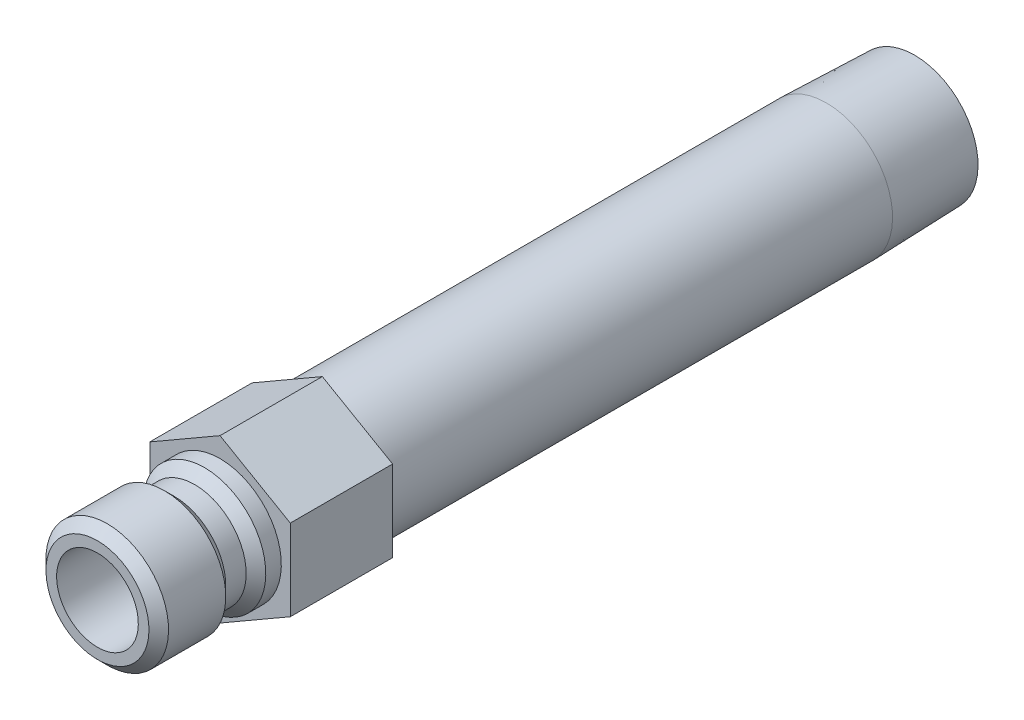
from build123d import *

# Parameters (mm, degrees)
SKETCH2_R           = 2.38125
BOSS_EXTRUDE1_DEPTH = 7.9502


with BuildPart() as part:
    # Sketch1 → Revolve1 (revolve)
    with BuildSketch(Plane(origin=(0, 0, 0), x_dir=(0, 0, -1), z_dir=(1, 0, 0))):
        Polygon((-9.525, 3.175), (-9.525, 4.0005), (-8.763, 4.7625), (-4.318, 4.7625), (-3.556, 4.0005), (-1.9685, 4.0005), (-1.2065, 4.7625), (0, 4.7625), (0, 5.1435), (47.117, 5.1435), (53.975, 4.929188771), (53.975, 2.38125), (0.127, 2.38125), (0.127, 3.175), align=None)
    revolve(axis=Axis((0, 0, 0), (0, 0, 1)))

    # Sketch2 → Boss-Extrude1 (add)
    with BuildSketch(Plane.XY):
        Polygon((-5.461, 3.15290982), (-5.461, -3.15290982), (0, -6.30581964), (5.461, -3.15290982), (5.461, 3.15290982), (0, 6.30581964), align=None)
        with Locations(Location((0, 0, 0), (0, 0, 90))):
            Circle(SKETCH2_R, mode=Mode.SUBTRACT)
    extrude(amount=-BOSS_EXTRUDE1_DEPTH)


solid = part.part
